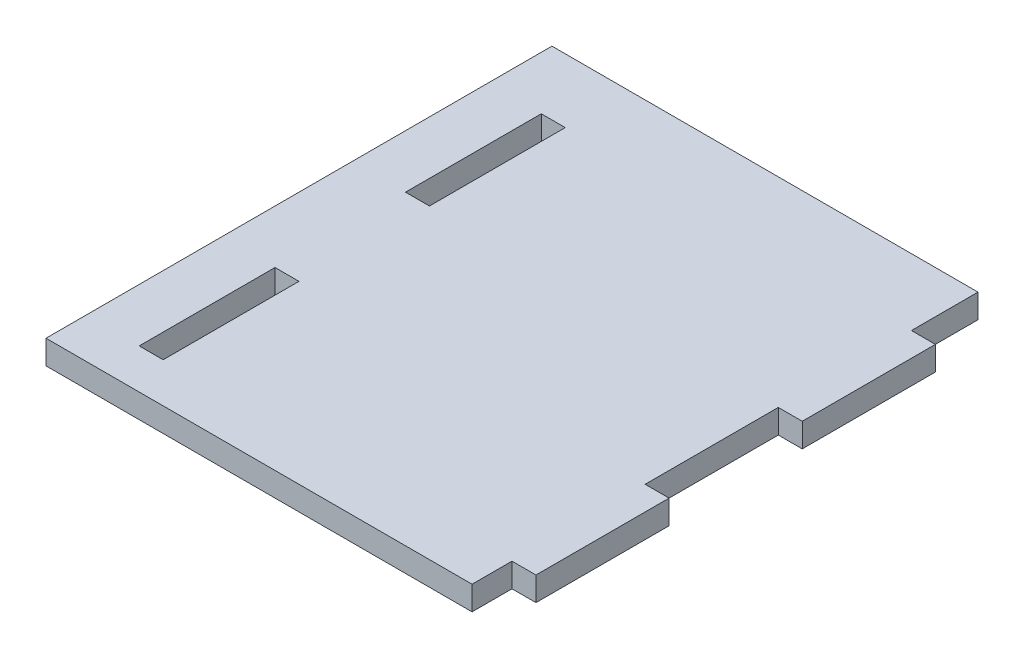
ISO-10303-21;
HEADER;
FILE_DESCRIPTION(('STEP AP214'),'2;1');
FILE_NAME('part.step','',(''),(''),'','','');
FILE_SCHEMA(('AUTOMOTIVE_DESIGN { 1 0 10303 214 1 1 1 1 }'));
ENDSEC;
DATA;
#1=APPLICATION_CONTEXT('core data for automotive mechanical design processes');
#2=APPLICATION_PROTOCOL_DEFINITION('international standard','automotive_design',2000,#1);
#3=PRODUCT_CONTEXT('',#1,'mechanical');
#4=PRODUCT('Part','Part','',(#3));
#5=PRODUCT_RELATED_PRODUCT_CATEGORY('part','',(#4));
#6=PRODUCT_DEFINITION_FORMATION('','',#4);
#7=PRODUCT_DEFINITION_CONTEXT('part definition',#1,'design');
#8=PRODUCT_DEFINITION('design','',#6,#7);
#9=PRODUCT_DEFINITION_SHAPE('','',#8);
#10=(LENGTH_UNIT() NAMED_UNIT(*) SI_UNIT(.MILLI.,.METRE.));
#11=(NAMED_UNIT(*) PLANE_ANGLE_UNIT() SI_UNIT($,.RADIAN.));
#12=(NAMED_UNIT(*) SI_UNIT($,.STERADIAN.) SOLID_ANGLE_UNIT());
#13=UNCERTAINTY_MEASURE_WITH_UNIT(LENGTH_MEASURE(1.E-05),#10,'distance_accuracy_value','');
#14=(GEOMETRIC_REPRESENTATION_CONTEXT(3) GLOBAL_UNCERTAINTY_ASSIGNED_CONTEXT((#13)) GLOBAL_UNIT_ASSIGNED_CONTEXT((#10,
#11,#12)) REPRESENTATION_CONTEXT('',''));
#15=CARTESIAN_POINT('',(0.,0.,0.));
#16=DIRECTION('',(0.,0.,1.));
#17=DIRECTION('',(1.,0.,0.));
#18=AXIS2_PLACEMENT_3D('',#15,#16,#17);
#19=CARTESIAN_POINT('',(0.,9.,0.));
#20=DIRECTION('',(0.,-1.,0.));
#21=DIRECTION('',(0.,0.,-1.));
#22=AXIS2_PLACEMENT_3D('',#19,#20,#21);
#23=PLANE('',#22);
#24=DIRECTION('',(0.,0.,1.));
#25=VECTOR('',#24,1.);
#26=CARTESIAN_POINT('',(-30.7369131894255,9.,0.250598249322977));
#27=LINE('',#26,#25);
#28=CARTESIAN_POINT('',(-30.7369131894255,9.,0.250598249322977));
#29=VERTEX_POINT('',#28);
#30=CARTESIAN_POINT('',(-30.7369131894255,9.,51.250598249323));
#31=VERTEX_POINT('',#30);
#32=EDGE_CURVE('E209',#29,#31,#27,.T.);
#33=ORIENTED_EDGE('',*,*,#32,.F.);
#34=DIRECTION('',(-1.,0.,0.));
#35=VECTOR('',#34,1.);
#36=CARTESIAN_POINT('',(-30.7369131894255,9.,0.250598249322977));
#37=LINE('',#36,#35);
#38=CARTESIAN_POINT('',(-21.7369131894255,9.,0.25059824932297));
#39=VERTEX_POINT('',#38);
#40=EDGE_CURVE('E217',#39,#29,#37,.T.);
#41=ORIENTED_EDGE('',*,*,#40,.F.);
#42=DIRECTION('',(0.,0.,-1.));
#43=VECTOR('',#42,1.);
#44=CARTESIAN_POINT('',(-21.7369131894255,9.,0.25059824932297));
#45=LINE('',#44,#43);
#46=CARTESIAN_POINT('',(-21.7369131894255,9.,51.250598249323));
#47=VERTEX_POINT('',#46);
#48=EDGE_CURVE('E214',#47,#39,#45,.T.);
#49=ORIENTED_EDGE('',*,*,#48,.F.);
#50=DIRECTION('',(1.,0.,0.));
#51=VECTOR('',#50,1.);
#52=CARTESIAN_POINT('',(-30.7369131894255,9.,51.250598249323));
#53=LINE('',#52,#51);
#54=EDGE_CURVE('E211',#31,#47,#53,.T.);
#55=ORIENTED_EDGE('',*,*,#54,.F.);
#56=EDGE_LOOP('',(#33,#41,#49,#55));
#57=FACE_BOUND('',#56,.T.);
#58=DIRECTION('',(1.,0.,0.));
#59=VECTOR('',#58,1.);
#60=CARTESIAN_POINT('',(-50.7369131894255,9.,-123.749401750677));
#61=LINE('',#60,#59);
#62=CARTESIAN_POINT('',(-50.7369131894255,9.,-123.749401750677));
#63=VERTEX_POINT('',#62);
#64=CARTESIAN_POINT('',(109.263086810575,9.,-123.749401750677));
#65=VERTEX_POINT('',#64);
#66=EDGE_CURVE('E240',#63,#65,#61,.T.);
#67=ORIENTED_EDGE('',*,*,#66,.F.);
#68=DIRECTION('',(0.,0.,1.));
#69=VECTOR('',#68,1.);
#70=CARTESIAN_POINT('',(-50.7369131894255,9.,-123.749401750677));
#71=LINE('',#70,#69);
#72=CARTESIAN_POINT('',(-50.7369131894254,9.,66.250598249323));
#73=VERTEX_POINT('',#72);
#74=EDGE_CURVE('E267',#63,#73,#71,.T.);
#75=ORIENTED_EDGE('',*,*,#74,.T.);
#76=DIRECTION('',(1.,0.,0.));
#77=VECTOR('',#76,1.);
#78=CARTESIAN_POINT('',(-50.7369131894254,9.,66.250598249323));
#79=LINE('',#78,#77);
#80=CARTESIAN_POINT('',(109.263086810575,9.,66.250598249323));
#81=VERTEX_POINT('',#80);
#82=EDGE_CURVE('E265',#73,#81,#79,.T.);
#83=ORIENTED_EDGE('',*,*,#82,.T.);
#84=DIRECTION('',(0.,0.,1.));
#85=VECTOR('',#84,1.);
#86=CARTESIAN_POINT('',(109.263086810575,9.,51.250598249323));
#87=LINE('',#86,#85);
#88=CARTESIAN_POINT('',(109.263086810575,9.,51.250598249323));
#89=VERTEX_POINT('',#88);
#90=EDGE_CURVE('E262',#89,#81,#87,.T.);
#91=ORIENTED_EDGE('',*,*,#90,.F.);
#92=DIRECTION('',(1.,0.,0.));
#93=VECTOR('',#92,1.);
#94=CARTESIAN_POINT('',(109.263086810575,9.,51.250598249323));
#95=LINE('',#94,#93);
#96=CARTESIAN_POINT('',(118.263086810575,9.,51.250598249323));
#97=VERTEX_POINT('',#96);
#98=EDGE_CURVE('E260',#89,#97,#95,.T.);
#99=ORIENTED_EDGE('',*,*,#98,.T.);
#100=DIRECTION('',(0.,0.,-1.));
#101=VECTOR('',#100,1.);
#102=CARTESIAN_POINT('',(118.263086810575,9.,51.250598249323));
#103=LINE('',#102,#101);
#104=CARTESIAN_POINT('',(118.263086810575,9.,1.25059824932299));
#105=VERTEX_POINT('',#104);
#106=EDGE_CURVE('E258',#97,#105,#103,.T.);
#107=ORIENTED_EDGE('',*,*,#106,.T.);
#108=DIRECTION('',(-1.,0.,0.));
#109=VECTOR('',#108,1.);
#110=CARTESIAN_POINT('',(118.263086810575,9.,1.25059824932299));
#111=LINE('',#110,#109);
#112=CARTESIAN_POINT('',(109.263086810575,9.,1.25059824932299));
#113=VERTEX_POINT('',#112);
#114=EDGE_CURVE('E256',#105,#113,#111,.T.);
#115=ORIENTED_EDGE('',*,*,#114,.T.);
#116=DIRECTION('',(0.,0.,1.));
#117=VECTOR('',#116,1.);
#118=CARTESIAN_POINT('',(109.263086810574,9.,-48.749401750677));
#119=LINE('',#118,#117);
#120=CARTESIAN_POINT('',(109.263086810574,9.,-48.749401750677));
#121=VERTEX_POINT('',#120);
#122=EDGE_CURVE('E253',#121,#113,#119,.T.);
#123=ORIENTED_EDGE('',*,*,#122,.F.);
#124=DIRECTION('',(1.,0.,0.));
#125=VECTOR('',#124,1.);
#126=CARTESIAN_POINT('',(109.263086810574,9.,-48.749401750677));
#127=LINE('',#126,#125);
#128=CARTESIAN_POINT('',(118.263086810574,9.,-48.749401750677));
#129=VERTEX_POINT('',#128);
#130=EDGE_CURVE('E251',#121,#129,#127,.T.);
#131=ORIENTED_EDGE('',*,*,#130,.T.);
#132=DIRECTION('',(0.,0.,-1.));
#133=VECTOR('',#132,1.);
#134=CARTESIAN_POINT('',(118.263086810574,9.,-48.749401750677));
#135=LINE('',#134,#133);
#136=CARTESIAN_POINT('',(118.263086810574,9.,-98.749401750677));
#137=VERTEX_POINT('',#136);
#138=EDGE_CURVE('E249',#129,#137,#135,.T.);
#139=ORIENTED_EDGE('',*,*,#138,.T.);
#140=DIRECTION('',(-1.,0.,0.));
#141=VECTOR('',#140,1.);
#142=CARTESIAN_POINT('',(118.263086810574,9.,-98.749401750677));
#143=LINE('',#142,#141);
#144=CARTESIAN_POINT('',(109.263086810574,9.,-98.749401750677));
#145=VERTEX_POINT('',#144);
#146=EDGE_CURVE('E247',#137,#145,#143,.T.);
#147=ORIENTED_EDGE('',*,*,#146,.T.);
#148=DIRECTION('',(0.,0.,1.));
#149=VECTOR('',#148,1.);
#150=CARTESIAN_POINT('',(109.263086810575,9.,-123.749401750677));
#151=LINE('',#150,#149);
#152=EDGE_CURVE('E243',#65,#145,#151,.T.);
#153=ORIENTED_EDGE('',*,*,#152,.F.);
#154=EDGE_LOOP('',(#67,#75,#83,#91,#99,#107,#115,#123,#131,#139,#147,#153));
#155=FACE_BOUND('',#154,.T.);
#156=DIRECTION('',(0.,0.,1.));
#157=VECTOR('',#156,1.);
#158=CARTESIAN_POINT('',(-30.7369131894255,9.,-99.749401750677));
#159=LINE('',#158,#157);
#160=CARTESIAN_POINT('',(-30.7369131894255,9.,-99.749401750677));
#161=VERTEX_POINT('',#160);
#162=CARTESIAN_POINT('',(-30.7369131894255,9.,-48.749401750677));
#163=VERTEX_POINT('',#162);
#164=EDGE_CURVE('E173',#161,#163,#159,.T.);
#165=ORIENTED_EDGE('',*,*,#164,.F.);
#166=DIRECTION('',(-1.,0.,0.));
#167=VECTOR('',#166,1.);
#168=CARTESIAN_POINT('',(-30.7369131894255,9.,-99.749401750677));
#169=LINE('',#168,#167);
#170=CARTESIAN_POINT('',(-21.7369131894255,9.,-99.7494017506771));
#171=VERTEX_POINT('',#170);
#172=EDGE_CURVE('E195',#171,#161,#169,.T.);
#173=ORIENTED_EDGE('',*,*,#172,.F.);
#174=DIRECTION('',(0.,0.,-1.));
#175=VECTOR('',#174,1.);
#176=CARTESIAN_POINT('',(-21.7369131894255,9.,-99.749401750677));
#177=LINE('',#176,#175);
#178=CARTESIAN_POINT('',(-21.7369131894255,9.,-48.749401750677));
#179=VERTEX_POINT('',#178);
#180=EDGE_CURVE('E193',#179,#171,#177,.T.);
#181=ORIENTED_EDGE('',*,*,#180,.F.);
#182=DIRECTION('',(1.,0.,0.));
#183=VECTOR('',#182,1.);
#184=CARTESIAN_POINT('',(-30.7369131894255,9.,-48.749401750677));
#185=LINE('',#184,#183);
#186=EDGE_CURVE('E181',#163,#179,#185,.T.);
#187=ORIENTED_EDGE('',*,*,#186,.F.);
#188=EDGE_LOOP('',(#165,#173,#181,#187));
#189=FACE_BOUND('',#188,.T.);
#190=ADVANCED_FACE('F35',(#57,#155,#189),#23,.F.);
#191=CARTESIAN_POINT('',(0.,0.,0.));
#192=DIRECTION('',(0.,-1.,0.));
#193=DIRECTION('',(0.,0.,-1.));
#194=AXIS2_PLACEMENT_3D('',#191,#192,#193);
#195=PLANE('',#194);
#196=DIRECTION('',(1.,0.,0.));
#197=VECTOR('',#196,1.);
#198=CARTESIAN_POINT('',(-50.7369131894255,0.,-123.749401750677));
#199=LINE('',#198,#197);
#200=CARTESIAN_POINT('',(-50.7369131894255,0.,-123.749401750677));
#201=VERTEX_POINT('',#200);
#202=CARTESIAN_POINT('',(109.263086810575,0.,-123.749401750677));
#203=VERTEX_POINT('',#202);
#204=EDGE_CURVE('E239',#201,#203,#199,.T.);
#205=ORIENTED_EDGE('',*,*,#204,.T.);
#206=DIRECTION('',(0.,0.,1.));
#207=VECTOR('',#206,1.);
#208=CARTESIAN_POINT('',(109.263086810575,0.,-123.749401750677));
#209=LINE('',#208,#207);
#210=CARTESIAN_POINT('',(109.263086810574,0.,-98.749401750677));
#211=VERTEX_POINT('',#210);
#212=EDGE_CURVE('E271',#203,#211,#209,.T.);
#213=ORIENTED_EDGE('',*,*,#212,.T.);
#214=DIRECTION('',(-1.,0.,0.));
#215=VECTOR('',#214,1.);
#216=CARTESIAN_POINT('',(118.263086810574,0.,-98.749401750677));
#217=LINE('',#216,#215);
#218=CARTESIAN_POINT('',(118.263086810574,0.,-98.749401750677));
#219=VERTEX_POINT('',#218);
#220=EDGE_CURVE('E274',#219,#211,#217,.T.);
#221=ORIENTED_EDGE('',*,*,#220,.F.);
#222=DIRECTION('',(0.,0.,-1.));
#223=VECTOR('',#222,1.);
#224=CARTESIAN_POINT('',(118.263086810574,0.,-48.749401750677));
#225=LINE('',#224,#223);
#226=CARTESIAN_POINT('',(118.263086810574,0.,-48.749401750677));
#227=VERTEX_POINT('',#226);
#228=EDGE_CURVE('E277',#227,#219,#225,.T.);
#229=ORIENTED_EDGE('',*,*,#228,.F.);
#230=DIRECTION('',(1.,0.,0.));
#231=VECTOR('',#230,1.);
#232=CARTESIAN_POINT('',(109.263086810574,0.,-48.749401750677));
#233=LINE('',#232,#231);
#234=CARTESIAN_POINT('',(109.263086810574,0.,-48.749401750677));
#235=VERTEX_POINT('',#234);
#236=EDGE_CURVE('E279',#235,#227,#233,.T.);
#237=ORIENTED_EDGE('',*,*,#236,.F.);
#238=DIRECTION('',(0.,0.,1.));
#239=VECTOR('',#238,1.);
#240=CARTESIAN_POINT('',(109.263086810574,0.,-48.749401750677));
#241=LINE('',#240,#239);
#242=CARTESIAN_POINT('',(109.263086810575,0.,1.25059824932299));
#243=VERTEX_POINT('',#242);
#244=EDGE_CURVE('E281',#235,#243,#241,.T.);
#245=ORIENTED_EDGE('',*,*,#244,.T.);
#246=DIRECTION('',(-1.,0.,0.));
#247=VECTOR('',#246,1.);
#248=CARTESIAN_POINT('',(118.263086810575,0.,1.25059824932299));
#249=LINE('',#248,#247);
#250=CARTESIAN_POINT('',(118.263086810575,0.,1.25059824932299));
#251=VERTEX_POINT('',#250);
#252=EDGE_CURVE('E284',#251,#243,#249,.T.);
#253=ORIENTED_EDGE('',*,*,#252,.F.);
#254=DIRECTION('',(0.,0.,-1.));
#255=VECTOR('',#254,1.);
#256=CARTESIAN_POINT('',(118.263086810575,0.,51.250598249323));
#257=LINE('',#256,#255);
#258=CARTESIAN_POINT('',(118.263086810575,0.,51.250598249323));
#259=VERTEX_POINT('',#258);
#260=EDGE_CURVE('E287',#259,#251,#257,.T.);
#261=ORIENTED_EDGE('',*,*,#260,.F.);
#262=DIRECTION('',(1.,0.,0.));
#263=VECTOR('',#262,1.);
#264=CARTESIAN_POINT('',(109.263086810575,0.,51.250598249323));
#265=LINE('',#264,#263);
#266=CARTESIAN_POINT('',(109.263086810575,0.,51.250598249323));
#267=VERTEX_POINT('',#266);
#268=EDGE_CURVE('E289',#267,#259,#265,.T.);
#269=ORIENTED_EDGE('',*,*,#268,.F.);
#270=DIRECTION('',(0.,0.,1.));
#271=VECTOR('',#270,1.);
#272=CARTESIAN_POINT('',(109.263086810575,0.,51.250598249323));
#273=LINE('',#272,#271);
#274=CARTESIAN_POINT('',(109.263086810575,0.,66.250598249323));
#275=VERTEX_POINT('',#274);
#276=EDGE_CURVE('E291',#267,#275,#273,.T.);
#277=ORIENTED_EDGE('',*,*,#276,.T.);
#278=DIRECTION('',(1.,0.,0.));
#279=VECTOR('',#278,1.);
#280=CARTESIAN_POINT('',(-50.7369131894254,0.,66.250598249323));
#281=LINE('',#280,#279);
#282=CARTESIAN_POINT('',(-50.7369131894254,0.,66.250598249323));
#283=VERTEX_POINT('',#282);
#284=EDGE_CURVE('E294',#283,#275,#281,.T.);
#285=ORIENTED_EDGE('',*,*,#284,.F.);
#286=DIRECTION('',(0.,0.,1.));
#287=VECTOR('',#286,1.);
#288=CARTESIAN_POINT('',(-50.7369131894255,0.,-123.749401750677));
#289=LINE('',#288,#287);
#290=EDGE_CURVE('E244',#201,#283,#289,.T.);
#291=ORIENTED_EDGE('',*,*,#290,.F.);
#292=EDGE_LOOP('',(#205,#213,#221,#229,#237,#245,#253,#261,#269,#277,#285,#291));
#293=FACE_BOUND('',#292,.T.);
#294=DIRECTION('',(-1.,0.,0.));
#295=VECTOR('',#294,1.);
#296=CARTESIAN_POINT('',(-30.7369131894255,0.,0.250598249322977));
#297=LINE('',#296,#295);
#298=CARTESIAN_POINT('',(-21.7369131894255,0.,0.25059824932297));
#299=VERTEX_POINT('',#298);
#300=CARTESIAN_POINT('',(-30.7369131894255,0.,0.250598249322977));
#301=VERTEX_POINT('',#300);
#302=EDGE_CURVE('E212',#299,#301,#297,.T.);
#303=ORIENTED_EDGE('',*,*,#302,.T.);
#304=DIRECTION('',(0.,0.,1.));
#305=VECTOR('',#304,1.);
#306=CARTESIAN_POINT('',(-30.7369131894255,0.,0.250598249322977));
#307=LINE('',#306,#305);
#308=CARTESIAN_POINT('',(-30.7369131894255,0.,51.250598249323));
#309=VERTEX_POINT('',#308);
#310=EDGE_CURVE('E189',#301,#309,#307,.T.);
#311=ORIENTED_EDGE('',*,*,#310,.T.);
#312=DIRECTION('',(1.,0.,0.));
#313=VECTOR('',#312,1.);
#314=CARTESIAN_POINT('',(-30.7369131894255,0.,51.250598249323));
#315=LINE('',#314,#313);
#316=CARTESIAN_POINT('',(-21.7369131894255,0.,51.250598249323));
#317=VERTEX_POINT('',#316);
#318=EDGE_CURVE('E222',#309,#317,#315,.T.);
#319=ORIENTED_EDGE('',*,*,#318,.T.);
#320=DIRECTION('',(0.,0.,-1.));
#321=VECTOR('',#320,1.);
#322=CARTESIAN_POINT('',(-21.7369131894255,0.,0.25059824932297));
#323=LINE('',#322,#321);
#324=EDGE_CURVE('E225',#317,#299,#323,.T.);
#325=ORIENTED_EDGE('',*,*,#324,.T.);
#326=EDGE_LOOP('',(#303,#311,#319,#325));
#327=FACE_BOUND('',#326,.T.);
#328=DIRECTION('',(-1.,0.,0.));
#329=VECTOR('',#328,1.);
#330=CARTESIAN_POINT('',(-30.7369131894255,0.,-99.749401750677));
#331=LINE('',#330,#329);
#332=CARTESIAN_POINT('',(-21.7369131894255,0.,-99.749401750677));
#333=VERTEX_POINT('',#332);
#334=CARTESIAN_POINT('',(-30.7369131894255,0.,-99.749401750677));
#335=VERTEX_POINT('',#334);
#336=EDGE_CURVE('E182',#333,#335,#331,.T.);
#337=ORIENTED_EDGE('',*,*,#336,.T.);
#338=DIRECTION('',(0.,0.,1.));
#339=VECTOR('',#338,1.);
#340=CARTESIAN_POINT('',(-30.7369131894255,0.,-99.749401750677));
#341=LINE('',#340,#339);
#342=CARTESIAN_POINT('',(-30.7369131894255,0.,-48.749401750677));
#343=VERTEX_POINT('',#342);
#344=EDGE_CURVE('E60',#335,#343,#341,.T.);
#345=ORIENTED_EDGE('',*,*,#344,.T.);
#346=DIRECTION('',(1.,0.,0.));
#347=VECTOR('',#346,1.);
#348=CARTESIAN_POINT('',(-30.7369131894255,0.,-48.749401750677));
#349=LINE('',#348,#347);
#350=CARTESIAN_POINT('',(-21.7369131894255,0.,-48.749401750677));
#351=VERTEX_POINT('',#350);
#352=EDGE_CURVE('E188',#343,#351,#349,.T.);
#353=ORIENTED_EDGE('',*,*,#352,.T.);
#354=DIRECTION('',(0.,0.,-1.));
#355=VECTOR('',#354,1.);
#356=CARTESIAN_POINT('',(-21.7369131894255,0.,-99.749401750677));
#357=LINE('',#356,#355);
#358=EDGE_CURVE('E201',#351,#333,#357,.T.);
#359=ORIENTED_EDGE('',*,*,#358,.T.);
#360=EDGE_LOOP('',(#337,#345,#353,#359));
#361=FACE_BOUND('',#360,.T.);
#362=ADVANCED_FACE('F331',(#293,#327,#361),#195,.T.);
#363=CARTESIAN_POINT('',(-50.7369131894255,9.,-123.749401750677));
#364=DIRECTION('',(0.,0.,-1.));
#365=DIRECTION('',(-1.,0.,0.));
#366=AXIS2_PLACEMENT_3D('',#363,#364,#365);
#367=PLANE('',#366);
#368=ORIENTED_EDGE('',*,*,#204,.F.);
#369=DIRECTION('',(0.,-1.,0.));
#370=VECTOR('',#369,1.);
#371=CARTESIAN_POINT('',(-50.7369131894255,9.,-123.749401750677));
#372=LINE('',#371,#370);
#373=EDGE_CURVE('E11',#63,#201,#372,.T.);
#374=ORIENTED_EDGE('',*,*,#373,.F.);
#375=ORIENTED_EDGE('',*,*,#66,.T.);
#376=DIRECTION('',(0.,-1.,0.));
#377=VECTOR('',#376,1.);
#378=CARTESIAN_POINT('',(109.263086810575,9.,-123.749401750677));
#379=LINE('',#378,#377);
#380=EDGE_CURVE('E39',#65,#203,#379,.T.);
#381=ORIENTED_EDGE('',*,*,#380,.T.);
#382=EDGE_LOOP('',(#368,#374,#375,#381));
#383=FACE_BOUND('',#382,.T.);
#384=ADVANCED_FACE('F37',(#383),#367,.T.);
#385=CARTESIAN_POINT('',(-50.7369131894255,9.,-123.749401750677));
#386=DIRECTION('',(1.,0.,0.));
#387=DIRECTION('',(0.,0.,-1.));
#388=AXIS2_PLACEMENT_3D('',#385,#386,#387);
#389=PLANE('',#388);
#390=ORIENTED_EDGE('',*,*,#290,.T.);
#391=DIRECTION('',(0.,-1.,0.));
#392=VECTOR('',#391,1.);
#393=CARTESIAN_POINT('',(-50.7369131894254,9.,66.250598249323));
#394=LINE('',#393,#392);
#395=EDGE_CURVE('E44',#73,#283,#394,.T.);
#396=ORIENTED_EDGE('',*,*,#395,.F.);
#397=ORIENTED_EDGE('',*,*,#74,.F.);
#398=ORIENTED_EDGE('',*,*,#373,.T.);
#399=EDGE_LOOP('',(#390,#396,#397,#398));
#400=FACE_BOUND('',#399,.T.);
#401=ADVANCED_FACE('F336',(#400),#389,.F.);
#402=CARTESIAN_POINT('',(-50.7369131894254,9.,66.250598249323));
#403=DIRECTION('',(0.,0.,-1.));
#404=DIRECTION('',(-1.,0.,0.));
#405=AXIS2_PLACEMENT_3D('',#402,#403,#404);
#406=PLANE('',#405);
#407=ORIENTED_EDGE('',*,*,#284,.T.);
#408=DIRECTION('',(0.,-1.,0.));
#409=VECTOR('',#408,1.);
#410=CARTESIAN_POINT('',(109.263086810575,9.,66.250598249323));
#411=LINE('',#410,#409);
#412=EDGE_CURVE('E300',#81,#275,#411,.T.);
#413=ORIENTED_EDGE('',*,*,#412,.F.);
#414=ORIENTED_EDGE('',*,*,#82,.F.);
#415=ORIENTED_EDGE('',*,*,#395,.T.);
#416=EDGE_LOOP('',(#407,#413,#414,#415));
#417=FACE_BOUND('',#416,.T.);
#418=ADVANCED_FACE('F340',(#417),#406,.F.);
#419=CARTESIAN_POINT('',(109.263086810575,9.,51.250598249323));
#420=DIRECTION('',(1.,0.,0.));
#421=DIRECTION('',(0.,0.,-1.));
#422=AXIS2_PLACEMENT_3D('',#419,#420,#421);
#423=PLANE('',#422);
#424=ORIENTED_EDGE('',*,*,#276,.F.);
#425=DIRECTION('',(0.,-1.,0.));
#426=VECTOR('',#425,1.);
#427=CARTESIAN_POINT('',(109.263086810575,9.,51.250598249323));
#428=LINE('',#427,#426);
#429=EDGE_CURVE('E302',#89,#267,#428,.T.);
#430=ORIENTED_EDGE('',*,*,#429,.F.);
#431=ORIENTED_EDGE('',*,*,#90,.T.);
#432=ORIENTED_EDGE('',*,*,#412,.T.);
#433=EDGE_LOOP('',(#424,#430,#431,#432));
#434=FACE_BOUND('',#433,.T.);
#435=ADVANCED_FACE('F378',(#434),#423,.T.);
#436=CARTESIAN_POINT('',(109.263086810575,9.,51.250598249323));
#437=DIRECTION('',(0.,0.,-1.));
#438=DIRECTION('',(-1.,0.,0.));
#439=AXIS2_PLACEMENT_3D('',#436,#437,#438);
#440=PLANE('',#439);
#441=ORIENTED_EDGE('',*,*,#268,.T.);
#442=DIRECTION('',(0.,-1.,0.));
#443=VECTOR('',#442,1.);
#444=CARTESIAN_POINT('',(118.263086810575,9.,51.250598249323));
#445=LINE('',#444,#443);
#446=EDGE_CURVE('E304',#97,#259,#445,.T.);
#447=ORIENTED_EDGE('',*,*,#446,.F.);
#448=ORIENTED_EDGE('',*,*,#98,.F.);
#449=ORIENTED_EDGE('',*,*,#429,.T.);
#450=EDGE_LOOP('',(#441,#447,#448,#449));
#451=FACE_BOUND('',#450,.T.);
#452=ADVANCED_FACE('F375',(#451),#440,.F.);
#453=CARTESIAN_POINT('',(118.263086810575,9.,51.250598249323));
#454=DIRECTION('',(-1.,0.,0.));
#455=DIRECTION('',(0.,0.,1.));
#456=AXIS2_PLACEMENT_3D('',#453,#454,#455);
#457=PLANE('',#456);
#458=ORIENTED_EDGE('',*,*,#260,.T.);
#459=DIRECTION('',(0.,-1.,0.));
#460=VECTOR('',#459,1.);
#461=CARTESIAN_POINT('',(118.263086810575,9.,1.25059824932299));
#462=LINE('',#461,#460);
#463=EDGE_CURVE('E307',#105,#251,#462,.T.);
#464=ORIENTED_EDGE('',*,*,#463,.F.);
#465=ORIENTED_EDGE('',*,*,#106,.F.);
#466=ORIENTED_EDGE('',*,*,#446,.T.);
#467=EDGE_LOOP('',(#458,#464,#465,#466));
#468=FACE_BOUND('',#467,.T.);
#469=ADVANCED_FACE('F371',(#468),#457,.F.);
#470=CARTESIAN_POINT('',(118.263086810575,9.,1.25059824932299));
#471=DIRECTION('',(0.,0.,1.));
#472=DIRECTION('',(1.,0.,0.));
#473=AXIS2_PLACEMENT_3D('',#470,#471,#472);
#474=PLANE('',#473);
#475=ORIENTED_EDGE('',*,*,#252,.T.);
#476=DIRECTION('',(0.,-1.,0.));
#477=VECTOR('',#476,1.);
#478=CARTESIAN_POINT('',(109.263086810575,9.,1.25059824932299));
#479=LINE('',#478,#477);
#480=EDGE_CURVE('E310',#113,#243,#479,.T.);
#481=ORIENTED_EDGE('',*,*,#480,.F.);
#482=ORIENTED_EDGE('',*,*,#114,.F.);
#483=ORIENTED_EDGE('',*,*,#463,.T.);
#484=EDGE_LOOP('',(#475,#481,#482,#483));
#485=FACE_BOUND('',#484,.T.);
#486=ADVANCED_FACE('F366',(#485),#474,.F.);
#487=CARTESIAN_POINT('',(109.263086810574,9.,-48.749401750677));
#488=DIRECTION('',(1.,0.,0.));
#489=DIRECTION('',(0.,0.,-1.));
#490=AXIS2_PLACEMENT_3D('',#487,#488,#489);
#491=PLANE('',#490);
#492=ORIENTED_EDGE('',*,*,#244,.F.);
#493=DIRECTION('',(0.,-1.,0.));
#494=VECTOR('',#493,1.);
#495=CARTESIAN_POINT('',(109.263086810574,9.,-48.749401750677));
#496=LINE('',#495,#494);
#497=EDGE_CURVE('E312',#121,#235,#496,.T.);
#498=ORIENTED_EDGE('',*,*,#497,.F.);
#499=ORIENTED_EDGE('',*,*,#122,.T.);
#500=ORIENTED_EDGE('',*,*,#480,.T.);
#501=EDGE_LOOP('',(#492,#498,#499,#500));
#502=FACE_BOUND('',#501,.T.);
#503=ADVANCED_FACE('F360',(#502),#491,.T.);
#504=CARTESIAN_POINT('',(109.263086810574,9.,-48.749401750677));
#505=DIRECTION('',(0.,0.,-1.));
#506=DIRECTION('',(-1.,0.,0.));
#507=AXIS2_PLACEMENT_3D('',#504,#505,#506);
#508=PLANE('',#507);
#509=ORIENTED_EDGE('',*,*,#236,.T.);
#510=DIRECTION('',(0.,-1.,0.));
#511=VECTOR('',#510,1.);
#512=CARTESIAN_POINT('',(118.263086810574,9.,-48.749401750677));
#513=LINE('',#512,#511);
#514=EDGE_CURVE('E314',#129,#227,#513,.T.);
#515=ORIENTED_EDGE('',*,*,#514,.F.);
#516=ORIENTED_EDGE('',*,*,#130,.F.);
#517=ORIENTED_EDGE('',*,*,#497,.T.);
#518=EDGE_LOOP('',(#509,#515,#516,#517));
#519=FACE_BOUND('',#518,.T.);
#520=ADVANCED_FACE('F357',(#519),#508,.F.);
#521=CARTESIAN_POINT('',(118.263086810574,9.,-48.749401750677));
#522=DIRECTION('',(-1.,0.,0.));
#523=DIRECTION('',(0.,0.,1.));
#524=AXIS2_PLACEMENT_3D('',#521,#522,#523);
#525=PLANE('',#524);
#526=ORIENTED_EDGE('',*,*,#228,.T.);
#527=DIRECTION('',(0.,-1.,0.));
#528=VECTOR('',#527,1.);
#529=CARTESIAN_POINT('',(118.263086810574,9.,-98.749401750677));
#530=LINE('',#529,#528);
#531=EDGE_CURVE('E317',#137,#219,#530,.T.);
#532=ORIENTED_EDGE('',*,*,#531,.F.);
#533=ORIENTED_EDGE('',*,*,#138,.F.);
#534=ORIENTED_EDGE('',*,*,#514,.T.);
#535=EDGE_LOOP('',(#526,#532,#533,#534));
#536=FACE_BOUND('',#535,.T.);
#537=ADVANCED_FACE('F353',(#536),#525,.F.);
#538=CARTESIAN_POINT('',(118.263086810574,9.,-98.749401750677));
#539=DIRECTION('',(0.,0.,1.));
#540=DIRECTION('',(1.,0.,0.));
#541=AXIS2_PLACEMENT_3D('',#538,#539,#540);
#542=PLANE('',#541);
#543=ORIENTED_EDGE('',*,*,#220,.T.);
#544=DIRECTION('',(0.,-1.,0.));
#545=VECTOR('',#544,1.);
#546=CARTESIAN_POINT('',(109.263086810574,9.,-98.749401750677));
#547=LINE('',#546,#545);
#548=EDGE_CURVE('E319',#145,#211,#547,.T.);
#549=ORIENTED_EDGE('',*,*,#548,.F.);
#550=ORIENTED_EDGE('',*,*,#146,.F.);
#551=ORIENTED_EDGE('',*,*,#531,.T.);
#552=EDGE_LOOP('',(#543,#549,#550,#551));
#553=FACE_BOUND('',#552,.T.);
#554=ADVANCED_FACE('F348',(#553),#542,.F.);
#555=CARTESIAN_POINT('',(109.263086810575,9.,-123.749401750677));
#556=DIRECTION('',(1.,0.,0.));
#557=DIRECTION('',(0.,0.,-1.));
#558=AXIS2_PLACEMENT_3D('',#555,#556,#557);
#559=PLANE('',#558);
#560=ORIENTED_EDGE('',*,*,#212,.F.);
#561=ORIENTED_EDGE('',*,*,#380,.F.);
#562=ORIENTED_EDGE('',*,*,#152,.T.);
#563=ORIENTED_EDGE('',*,*,#548,.T.);
#564=EDGE_LOOP('',(#560,#561,#562,#563));
#565=FACE_BOUND('',#564,.T.);
#566=ADVANCED_FACE('F327',(#565),#559,.T.);
#567=CARTESIAN_POINT('',(-30.7369131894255,9.,0.250598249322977));
#568=DIRECTION('',(1.,0.,0.));
#569=DIRECTION('',(0.,0.,-1.));
#570=AXIS2_PLACEMENT_3D('',#567,#568,#569);
#571=PLANE('',#570);
#572=ORIENTED_EDGE('',*,*,#310,.F.);
#573=DIRECTION('',(0.,-1.,0.));
#574=VECTOR('',#573,1.);
#575=CARTESIAN_POINT('',(-30.7369131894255,9.,0.250598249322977));
#576=LINE('',#575,#574);
#577=EDGE_CURVE('E219',#29,#301,#576,.T.);
#578=ORIENTED_EDGE('',*,*,#577,.F.);
#579=ORIENTED_EDGE('',*,*,#32,.T.);
#580=DIRECTION('',(0.,-1.,0.));
#581=VECTOR('',#580,1.);
#582=CARTESIAN_POINT('',(-30.7369131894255,9.,51.250598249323));
#583=LINE('',#582,#581);
#584=EDGE_CURVE('E236',#31,#309,#583,.T.);
#585=ORIENTED_EDGE('',*,*,#584,.T.);
#586=EDGE_LOOP('',(#572,#578,#579,#585));
#587=FACE_BOUND('',#586,.T.);
#588=ADVANCED_FACE('F396',(#587),#571,.T.);
#589=CARTESIAN_POINT('',(-30.7369131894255,9.,51.250598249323));
#590=DIRECTION('',(0.,0.,-1.));
#591=DIRECTION('',(-1.,0.,0.));
#592=AXIS2_PLACEMENT_3D('',#589,#590,#591);
#593=PLANE('',#592);
#594=ORIENTED_EDGE('',*,*,#318,.F.);
#595=ORIENTED_EDGE('',*,*,#584,.F.);
#596=ORIENTED_EDGE('',*,*,#54,.T.);
#597=DIRECTION('',(0.,-1.,0.));
#598=VECTOR('',#597,1.);
#599=CARTESIAN_POINT('',(-21.7369131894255,9.,51.250598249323));
#600=LINE('',#599,#598);
#601=EDGE_CURVE('E234',#47,#317,#600,.T.);
#602=ORIENTED_EDGE('',*,*,#601,.T.);
#603=EDGE_LOOP('',(#594,#595,#596,#602));
#604=FACE_BOUND('',#603,.T.);
#605=ADVANCED_FACE('F459',(#604),#593,.T.);
#606=CARTESIAN_POINT('',(-21.7369131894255,9.,0.25059824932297));
#607=DIRECTION('',(-1.,0.,0.));
#608=DIRECTION('',(0.,0.,1.));
#609=AXIS2_PLACEMENT_3D('',#606,#607,#608);
#610=PLANE('',#609);
#611=ORIENTED_EDGE('',*,*,#324,.F.);
#612=ORIENTED_EDGE('',*,*,#601,.F.);
#613=ORIENTED_EDGE('',*,*,#48,.T.);
#614=DIRECTION('',(0.,-1.,0.));
#615=VECTOR('',#614,1.);
#616=CARTESIAN_POINT('',(-21.7369131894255,9.,0.25059824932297));
#617=LINE('',#616,#615);
#618=EDGE_CURVE('E232',#39,#299,#617,.T.);
#619=ORIENTED_EDGE('',*,*,#618,.T.);
#620=EDGE_LOOP('',(#611,#612,#613,#619));
#621=FACE_BOUND('',#620,.T.);
#622=ADVANCED_FACE('F456',(#621),#610,.T.);
#623=CARTESIAN_POINT('',(-30.7369131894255,9.,0.250598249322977));
#624=DIRECTION('',(0.,0.,1.));
#625=DIRECTION('',(1.,0.,0.));
#626=AXIS2_PLACEMENT_3D('',#623,#624,#625);
#627=PLANE('',#626);
#628=ORIENTED_EDGE('',*,*,#302,.F.);
#629=ORIENTED_EDGE('',*,*,#618,.F.);
#630=ORIENTED_EDGE('',*,*,#40,.T.);
#631=ORIENTED_EDGE('',*,*,#577,.T.);
#632=EDGE_LOOP('',(#628,#629,#630,#631));
#633=FACE_BOUND('',#632,.T.);
#634=ADVANCED_FACE('F422',(#633),#627,.T.);
#635=CARTESIAN_POINT('',(-30.7369131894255,9.,-99.749401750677));
#636=DIRECTION('',(1.,0.,0.));
#637=DIRECTION('',(0.,0.,-1.));
#638=AXIS2_PLACEMENT_3D('',#635,#636,#637);
#639=PLANE('',#638);
#640=ORIENTED_EDGE('',*,*,#344,.F.);
#641=DIRECTION('',(0.,-1.,0.));
#642=VECTOR('',#641,1.);
#643=CARTESIAN_POINT('',(-30.7369131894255,9.,-99.749401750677));
#644=LINE('',#643,#642);
#645=EDGE_CURVE('E177',#161,#335,#644,.T.);
#646=ORIENTED_EDGE('',*,*,#645,.F.);
#647=ORIENTED_EDGE('',*,*,#164,.T.);
#648=DIRECTION('',(0.,-1.,0.));
#649=VECTOR('',#648,1.);
#650=CARTESIAN_POINT('',(-30.7369131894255,9.,-48.749401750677));
#651=LINE('',#650,#649);
#652=EDGE_CURVE('E176',#163,#343,#651,.T.);
#653=ORIENTED_EDGE('',*,*,#652,.T.);
#654=EDGE_LOOP('',(#640,#646,#647,#653));
#655=FACE_BOUND('',#654,.T.);
#656=ADVANCED_FACE('F175',(#655),#639,.T.);
#657=CARTESIAN_POINT('',(-30.7369131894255,9.,-48.749401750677));
#658=DIRECTION('',(0.,0.,-1.));
#659=DIRECTION('',(-1.,0.,0.));
#660=AXIS2_PLACEMENT_3D('',#657,#658,#659);
#661=PLANE('',#660);
#662=ORIENTED_EDGE('',*,*,#352,.F.);
#663=ORIENTED_EDGE('',*,*,#652,.F.);
#664=ORIENTED_EDGE('',*,*,#186,.T.);
#665=DIRECTION('',(0.,-1.,0.));
#666=VECTOR('',#665,1.);
#667=CARTESIAN_POINT('',(-21.7369131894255,9.,-48.749401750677));
#668=LINE('',#667,#666);
#669=EDGE_CURVE('E190',#179,#351,#668,.T.);
#670=ORIENTED_EDGE('',*,*,#669,.T.);
#671=EDGE_LOOP('',(#662,#663,#664,#670));
#672=FACE_BOUND('',#671,.T.);
#673=ADVANCED_FACE('F185',(#672),#661,.T.);
#674=CARTESIAN_POINT('',(-21.7369131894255,9.,-99.749401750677));
#675=DIRECTION('',(-1.,0.,0.));
#676=DIRECTION('',(0.,0.,1.));
#677=AXIS2_PLACEMENT_3D('',#674,#675,#676);
#678=PLANE('',#677);
#679=ORIENTED_EDGE('',*,*,#358,.F.);
#680=ORIENTED_EDGE('',*,*,#669,.F.);
#681=ORIENTED_EDGE('',*,*,#180,.T.);
#682=DIRECTION('',(0.,-1.,0.));
#683=VECTOR('',#682,1.);
#684=CARTESIAN_POINT('',(-21.7369131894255,9.,-99.749401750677));
#685=LINE('',#684,#683);
#686=EDGE_CURVE('E52',#171,#333,#685,.T.);
#687=ORIENTED_EDGE('',*,*,#686,.T.);
#688=EDGE_LOOP('',(#679,#680,#681,#687));
#689=FACE_BOUND('',#688,.T.);
#690=ADVANCED_FACE('F432',(#689),#678,.T.);
#691=CARTESIAN_POINT('',(-30.7369131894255,9.,-99.749401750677));
#692=DIRECTION('',(0.,0.,1.));
#693=DIRECTION('',(1.,0.,0.));
#694=AXIS2_PLACEMENT_3D('',#691,#692,#693);
#695=PLANE('',#694);
#696=ORIENTED_EDGE('',*,*,#336,.F.);
#697=ORIENTED_EDGE('',*,*,#686,.F.);
#698=ORIENTED_EDGE('',*,*,#172,.T.);
#699=ORIENTED_EDGE('',*,*,#645,.T.);
#700=EDGE_LOOP('',(#696,#697,#698,#699));
#701=FACE_BOUND('',#700,.T.);
#702=ADVANCED_FACE('F441',(#701),#695,.T.);
#703=CLOSED_SHELL('',(#190,#362,#384,#401,#418,#435,#452,#469,#486,#503,#520,#537,#554,#566,
#588,#605,#622,#634,#656,#673,#690,#702));
#704=MANIFOLD_SOLID_BREP('B2',#703);
#705=ADVANCED_BREP_SHAPE_REPRESENTATION('',(#18,#704),#14);
#706=SHAPE_DEFINITION_REPRESENTATION(#9,#705);
ENDSEC;
END-ISO-10303-21;
